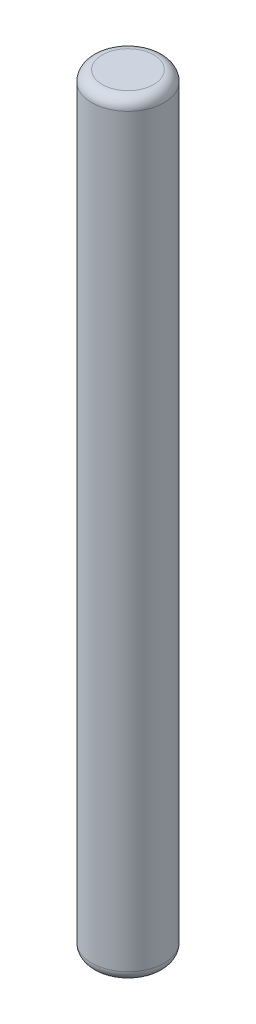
ISO-10303-21;
HEADER;
FILE_DESCRIPTION(('STEP AP214'),'2;1');
FILE_NAME('part.step','',(''),(''),'','','');
FILE_SCHEMA(('AUTOMOTIVE_DESIGN { 1 0 10303 214 1 1 1 1 }'));
ENDSEC;
DATA;
#1=APPLICATION_CONTEXT('core data for automotive mechanical design processes');
#2=APPLICATION_PROTOCOL_DEFINITION('international standard','automotive_design',2000,#1);
#3=PRODUCT_CONTEXT('',#1,'mechanical');
#4=PRODUCT('Part','Part','',(#3));
#5=PRODUCT_RELATED_PRODUCT_CATEGORY('part','',(#4));
#6=PRODUCT_DEFINITION_FORMATION('','',#4);
#7=PRODUCT_DEFINITION_CONTEXT('part definition',#1,'design');
#8=PRODUCT_DEFINITION('design','',#6,#7);
#9=PRODUCT_DEFINITION_SHAPE('','',#8);
#10=(LENGTH_UNIT() NAMED_UNIT(*) SI_UNIT(.MILLI.,.METRE.));
#11=(NAMED_UNIT(*) PLANE_ANGLE_UNIT() SI_UNIT($,.RADIAN.));
#12=(NAMED_UNIT(*) SI_UNIT($,.STERADIAN.) SOLID_ANGLE_UNIT());
#13=UNCERTAINTY_MEASURE_WITH_UNIT(LENGTH_MEASURE(1.E-05),#10,'distance_accuracy_value','');
#14=(GEOMETRIC_REPRESENTATION_CONTEXT(3) GLOBAL_UNCERTAINTY_ASSIGNED_CONTEXT((#13)) GLOBAL_UNIT_ASSIGNED_CONTEXT((#10,
#11,#12)) REPRESENTATION_CONTEXT('',''));
#15=CARTESIAN_POINT('',(0.,0.,0.));
#16=DIRECTION('',(0.,0.,1.));
#17=DIRECTION('',(1.,0.,0.));
#18=AXIS2_PLACEMENT_3D('',#15,#16,#17);
#19=CARTESIAN_POINT('',(0.,73.,0.));
#20=DIRECTION('',(0.,-1.,0.));
#21=DIRECTION('',(0.,0.,-1.));
#22=AXIS2_PLACEMENT_3D('',#19,#20,#21);
#23=CYLINDRICAL_SURFACE('',#22,3.45);
#24=CARTESIAN_POINT('',(0.,72.,0.));
#25=DIRECTION('',(0.,1.,0.));
#26=DIRECTION('',(0.,0.,1.));
#27=AXIS2_PLACEMENT_3D('',#24,#25,#26);
#28=CIRCLE('',#27,3.45);
#29=CARTESIAN_POINT('',(0.,72.,3.45));
#30=VERTEX_POINT('',#29);
#31=EDGE_CURVE('E38',#30,#30,#28,.F.);
#32=ORIENTED_EDGE('',*,*,#31,.T.);
#33=EDGE_LOOP('',(#32));
#34=FACE_BOUND('',#33,.T.);
#35=CARTESIAN_POINT('',(0.,1.,0.));
#36=DIRECTION('',(0.,1.,0.));
#37=DIRECTION('',(0.,0.,1.));
#38=AXIS2_PLACEMENT_3D('',#35,#36,#37);
#39=CIRCLE('',#38,3.45);
#40=CARTESIAN_POINT('',(0.,1.,3.45));
#41=VERTEX_POINT('',#40);
#42=EDGE_CURVE('E42',#41,#41,#39,.T.);
#43=ORIENTED_EDGE('',*,*,#42,.T.);
#44=EDGE_LOOP('',(#43));
#45=FACE_BOUND('',#44,.T.);
#46=ADVANCED_FACE('F31',(#34,#45),#23,.T.);
#47=CARTESIAN_POINT('',(0.,73.,0.));
#48=DIRECTION('',(0.,1.,0.));
#49=DIRECTION('',(0.,0.,1.));
#50=AXIS2_PLACEMENT_3D('',#47,#48,#49);
#51=PLANE('',#50);
#52=CARTESIAN_POINT('',(0.,73.,0.));
#53=DIRECTION('',(0.,1.,0.));
#54=DIRECTION('',(0.,0.,1.));
#55=AXIS2_PLACEMENT_3D('',#52,#53,#54);
#56=CIRCLE('',#55,2.45);
#57=CARTESIAN_POINT('',(0.,73.,2.45));
#58=VERTEX_POINT('',#57);
#59=EDGE_CURVE('E46',#58,#58,#56,.T.);
#60=ORIENTED_EDGE('',*,*,#59,.T.);
#61=EDGE_LOOP('',(#60));
#62=FACE_BOUND('',#61,.T.);
#63=ADVANCED_FACE('F52',(#62),#51,.T.);
#64=CARTESIAN_POINT('',(0.,0.,0.));
#65=DIRECTION('',(0.,1.,0.));
#66=DIRECTION('',(0.,0.,1.));
#67=AXIS2_PLACEMENT_3D('',#64,#65,#66);
#68=PLANE('',#67);
#69=CARTESIAN_POINT('',(0.,0.,0.));
#70=DIRECTION('',(0.,1.,0.));
#71=DIRECTION('',(0.,0.,1.));
#72=AXIS2_PLACEMENT_3D('',#69,#70,#71);
#73=CIRCLE('',#72,2.45);
#74=CARTESIAN_POINT('',(0.,0.,2.45));
#75=VERTEX_POINT('',#74);
#76=EDGE_CURVE('E10',#75,#75,#73,.F.);
#77=ORIENTED_EDGE('',*,*,#76,.T.);
#78=EDGE_LOOP('',(#77));
#79=FACE_BOUND('',#78,.T.);
#80=ADVANCED_FACE('F56',(#79),#68,.F.);
#81=CARTESIAN_POINT('',(0.,72.,0.));
#82=DIRECTION('',(0.,1.,0.));
#83=DIRECTION('',(0.,0.,1.));
#84=AXIS2_PLACEMENT_3D('',#81,#82,#83);
#85=TOROIDAL_SURFACE('',#84,2.45,1.);
#86=ORIENTED_EDGE('',*,*,#31,.F.);
#87=EDGE_LOOP('',(#86));
#88=FACE_BOUND('',#87,.T.);
#89=ORIENTED_EDGE('',*,*,#59,.F.);
#90=EDGE_LOOP('',(#89));
#91=FACE_BOUND('',#90,.T.);
#92=ADVANCED_FACE('F54',(#88,#91),#85,.T.);
#93=CARTESIAN_POINT('',(0.,1.,0.));
#94=DIRECTION('',(0.,1.,0.));
#95=DIRECTION('',(0.,0.,1.));
#96=AXIS2_PLACEMENT_3D('',#93,#94,#95);
#97=TOROIDAL_SURFACE('',#96,2.45,1.);
#98=ORIENTED_EDGE('',*,*,#76,.F.);
#99=EDGE_LOOP('',(#98));
#100=FACE_BOUND('',#99,.T.);
#101=ORIENTED_EDGE('',*,*,#42,.F.);
#102=EDGE_LOOP('',(#101));
#103=FACE_BOUND('',#102,.T.);
#104=ADVANCED_FACE('F33',(#100,#103),#97,.T.);
#105=CLOSED_SHELL('',(#46,#63,#80,#92,#104));
#106=MANIFOLD_SOLID_BREP('B2',#105);
#107=ADVANCED_BREP_SHAPE_REPRESENTATION('',(#18,#106),#14);
#108=SHAPE_DEFINITION_REPRESENTATION(#9,#107);
ENDSEC;
END-ISO-10303-21;
